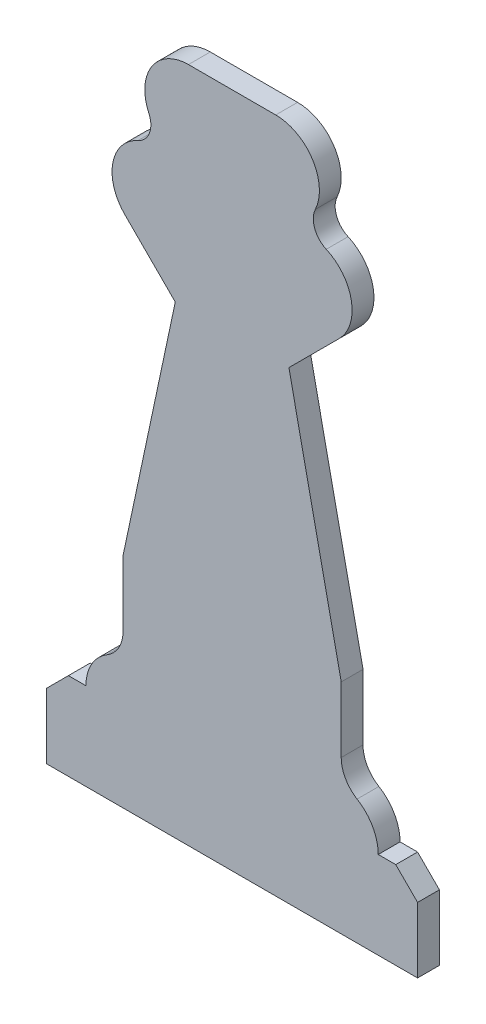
ISO-10303-21;
HEADER;
FILE_DESCRIPTION(('STEP AP214'),'2;1');
FILE_NAME('part.step','',(''),(''),'','','');
FILE_SCHEMA(('AUTOMOTIVE_DESIGN { 1 0 10303 214 1 1 1 1 }'));
ENDSEC;
DATA;
#1=APPLICATION_CONTEXT('core data for automotive mechanical design processes');
#2=APPLICATION_PROTOCOL_DEFINITION('international standard','automotive_design',2000,#1);
#3=PRODUCT_CONTEXT('',#1,'mechanical');
#4=PRODUCT('Part','Part','',(#3));
#5=PRODUCT_RELATED_PRODUCT_CATEGORY('part','',(#4));
#6=PRODUCT_DEFINITION_FORMATION('','',#4);
#7=PRODUCT_DEFINITION_CONTEXT('part definition',#1,'design');
#8=PRODUCT_DEFINITION('design','',#6,#7);
#9=PRODUCT_DEFINITION_SHAPE('','',#8);
#10=(LENGTH_UNIT() NAMED_UNIT(*) SI_UNIT(.MILLI.,.METRE.));
#11=(NAMED_UNIT(*) PLANE_ANGLE_UNIT() SI_UNIT($,.RADIAN.));
#12=(NAMED_UNIT(*) SI_UNIT($,.STERADIAN.) SOLID_ANGLE_UNIT());
#13=UNCERTAINTY_MEASURE_WITH_UNIT(LENGTH_MEASURE(1.E-05),#10,'distance_accuracy_value','');
#14=(GEOMETRIC_REPRESENTATION_CONTEXT(3) GLOBAL_UNCERTAINTY_ASSIGNED_CONTEXT((#13)) GLOBAL_UNIT_ASSIGNED_CONTEXT((#10,
#11,#12)) REPRESENTATION_CONTEXT('',''));
#15=CARTESIAN_POINT('',(0.,0.,0.));
#16=DIRECTION('',(0.,0.,1.));
#17=DIRECTION('',(1.,0.,0.));
#18=AXIS2_PLACEMENT_3D('',#15,#16,#17);
#19=CARTESIAN_POINT('',(-10.,20.,2.));
#20=DIRECTION('',(0.978147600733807,-0.207911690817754,0.));
#21=DIRECTION('',(0.207911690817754,0.978147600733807,0.));
#22=AXIS2_PLACEMENT_3D('',#19,#20,#21);
#23=PLANE('',#22);
#24=DIRECTION('',(-0.207911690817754,-0.978147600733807,0.));
#25=VECTOR('',#24,1.);
#26=CARTESIAN_POINT('',(-10.,20.,0.));
#27=LINE('',#26,#25);
#28=CARTESIAN_POINT('',(-5.20685036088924,42.5499961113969,0.));
#29=VERTEX_POINT('',#28);
#30=CARTESIAN_POINT('',(-10.,20.,0.));
#31=VERTEX_POINT('',#30);
#32=EDGE_CURVE('E229',#29,#31,#27,.T.);
#33=ORIENTED_EDGE('',*,*,#32,.T.);
#34=DIRECTION('',(0.,0.,-1.));
#35=VECTOR('',#34,1.);
#36=CARTESIAN_POINT('',(-10.,20.,2.));
#37=LINE('',#36,#35);
#38=CARTESIAN_POINT('',(-10.,20.,2.));
#39=VERTEX_POINT('',#38);
#40=EDGE_CURVE('E11',#39,#31,#37,.T.);
#41=ORIENTED_EDGE('',*,*,#40,.F.);
#42=DIRECTION('',(-0.207911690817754,-0.978147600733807,0.));
#43=VECTOR('',#42,1.);
#44=CARTESIAN_POINT('',(-10.,20.,2.));
#45=LINE('',#44,#43);
#46=CARTESIAN_POINT('',(-5.20685036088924,42.5499961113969,2.));
#47=VERTEX_POINT('',#46);
#48=EDGE_CURVE('E275',#47,#39,#45,.T.);
#49=ORIENTED_EDGE('',*,*,#48,.F.);
#50=DIRECTION('',(0.,0.,-1.));
#51=VECTOR('',#50,1.);
#52=CARTESIAN_POINT('',(-5.20685036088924,42.5499961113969,2.));
#53=LINE('',#52,#51);
#54=EDGE_CURVE('E225',#47,#29,#53,.T.);
#55=ORIENTED_EDGE('',*,*,#54,.T.);
#56=EDGE_LOOP('',(#33,#41,#49,#55));
#57=FACE_BOUND('',#56,.T.);
#58=ADVANCED_FACE('F37',(#57),#23,.F.);
#59=CARTESIAN_POINT('',(-10.,14.,2.));
#60=DIRECTION('',(1.,0.,0.));
#61=DIRECTION('',(0.,0.,-1.));
#62=AXIS2_PLACEMENT_3D('',#59,#60,#61);
#63=PLANE('',#62);
#64=DIRECTION('',(0.,-1.,0.));
#65=VECTOR('',#64,1.);
#66=CARTESIAN_POINT('',(-10.,14.,0.));
#67=LINE('',#66,#65);
#68=CARTESIAN_POINT('',(-10.,14.,0.));
#69=VERTEX_POINT('',#68);
#70=EDGE_CURVE('E232',#31,#69,#67,.T.);
#71=ORIENTED_EDGE('',*,*,#70,.T.);
#72=DIRECTION('',(0.,0.,-1.));
#73=VECTOR('',#72,1.);
#74=CARTESIAN_POINT('',(-10.,14.,2.));
#75=LINE('',#74,#73);
#76=CARTESIAN_POINT('',(-10.,14.,2.));
#77=VERTEX_POINT('',#76);
#78=EDGE_CURVE('E45',#77,#69,#75,.T.);
#79=ORIENTED_EDGE('',*,*,#78,.F.);
#80=DIRECTION('',(0.,-1.,0.));
#81=VECTOR('',#80,1.);
#82=CARTESIAN_POINT('',(-10.,14.,2.));
#83=LINE('',#82,#81);
#84=EDGE_CURVE('E144',#39,#77,#83,.T.);
#85=ORIENTED_EDGE('',*,*,#84,.F.);
#86=ORIENTED_EDGE('',*,*,#40,.T.);
#87=EDGE_LOOP('',(#71,#79,#85,#86));
#88=FACE_BOUND('',#87,.T.);
#89=ADVANCED_FACE('F413',(#88),#63,.F.);
#90=CARTESIAN_POINT('',(-13.,14.,2.));
#91=DIRECTION('',(0.,0.,-1.));
#92=DIRECTION('',(-1.,0.,0.));
#93=AXIS2_PLACEMENT_3D('',#90,#91,#92);
#94=CYLINDRICAL_SURFACE('',#93,3.);
#95=CARTESIAN_POINT('',(-13.,14.,0.));
#96=DIRECTION('',(0.,0.,-1.));
#97=DIRECTION('',(1.,0.,0.));
#98=AXIS2_PLACEMENT_3D('',#95,#96,#97);
#99=CIRCLE('',#98,3.);
#100=CARTESIAN_POINT('',(-11.4547637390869,11.4285714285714,0.));
#101=VERTEX_POINT('',#100);
#102=EDGE_CURVE('E234',#69,#101,#99,.T.);
#103=ORIENTED_EDGE('',*,*,#102,.T.);
#104=DIRECTION('',(0.,0.,-1.));
#105=VECTOR('',#104,1.);
#106=CARTESIAN_POINT('',(-11.4547637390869,11.4285714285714,2.));
#107=LINE('',#106,#105);
#108=CARTESIAN_POINT('',(-11.4547637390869,11.4285714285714,2.));
#109=VERTEX_POINT('',#108);
#110=EDGE_CURVE('E330',#109,#101,#107,.T.);
#111=ORIENTED_EDGE('',*,*,#110,.F.);
#112=CARTESIAN_POINT('',(-13.,14.,2.));
#113=DIRECTION('',(0.,0.,-1.));
#114=DIRECTION('',(1.,0.,0.));
#115=AXIS2_PLACEMENT_3D('',#112,#113,#114);
#116=CIRCLE('',#115,3.);
#117=EDGE_CURVE('E338',#77,#109,#116,.T.);
#118=ORIENTED_EDGE('',*,*,#117,.F.);
#119=ORIENTED_EDGE('',*,*,#78,.T.);
#120=EDGE_LOOP('',(#103,#111,#118,#119));
#121=FACE_BOUND('',#120,.T.);
#122=ADVANCED_FACE('F336',(#121),#94,.F.);
#123=CARTESIAN_POINT('',(-9.39444872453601,8.,2.));
#124=DIRECTION('',(0.,0.,-1.));
#125=DIRECTION('',(-1.,0.,0.));
#126=AXIS2_PLACEMENT_3D('',#123,#124,#125);
#127=CYLINDRICAL_SURFACE('',#126,4.);
#128=CARTESIAN_POINT('',(-9.39444872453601,8.,0.));
#129=DIRECTION('',(0.,0.,1.));
#130=DIRECTION('',(-1.,0.,0.));
#131=AXIS2_PLACEMENT_3D('',#128,#129,#130);
#132=CIRCLE('',#131,4.);
#133=CARTESIAN_POINT('',(-13.394448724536,8.,0.));
#134=VERTEX_POINT('',#133);
#135=EDGE_CURVE('E236',#101,#134,#132,.T.);
#136=ORIENTED_EDGE('',*,*,#135,.T.);
#137=DIRECTION('',(0.,0.,-1.));
#138=VECTOR('',#137,1.);
#139=CARTESIAN_POINT('',(-13.394448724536,8.,2.));
#140=LINE('',#139,#138);
#141=CARTESIAN_POINT('',(-13.394448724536,8.,2.));
#142=VERTEX_POINT('',#141);
#143=EDGE_CURVE('E327',#142,#134,#140,.T.);
#144=ORIENTED_EDGE('',*,*,#143,.F.);
#145=CARTESIAN_POINT('',(-9.39444872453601,8.,2.));
#146=DIRECTION('',(0.,0.,1.));
#147=DIRECTION('',(-1.,0.,0.));
#148=AXIS2_PLACEMENT_3D('',#145,#146,#147);
#149=CIRCLE('',#148,4.);
#150=EDGE_CURVE('E356',#109,#142,#149,.T.);
#151=ORIENTED_EDGE('',*,*,#150,.F.);
#152=ORIENTED_EDGE('',*,*,#110,.T.);
#153=EDGE_LOOP('',(#136,#144,#151,#152));
#154=FACE_BOUND('',#153,.T.);
#155=ADVANCED_FACE('F347',(#154),#127,.T.);
#156=CARTESIAN_POINT('',(-15.,8.,2.));
#157=DIRECTION('',(0.,-1.,0.));
#158=DIRECTION('',(1.,0.,0.));
#159=AXIS2_PLACEMENT_3D('',#156,#157,#158);
#160=PLANE('',#159);
#161=DIRECTION('',(-1.,0.,0.));
#162=VECTOR('',#161,1.);
#163=CARTESIAN_POINT('',(-15.,8.,0.));
#164=LINE('',#163,#162);
#165=CARTESIAN_POINT('',(-15.,8.,0.));
#166=VERTEX_POINT('',#165);
#167=EDGE_CURVE('E238',#134,#166,#164,.T.);
#168=ORIENTED_EDGE('',*,*,#167,.T.);
#169=DIRECTION('',(0.,0.,-1.));
#170=VECTOR('',#169,1.);
#171=CARTESIAN_POINT('',(-15.,8.,2.));
#172=LINE('',#171,#170);
#173=CARTESIAN_POINT('',(-15.,8.,2.));
#174=VERTEX_POINT('',#173);
#175=EDGE_CURVE('E324',#174,#166,#172,.T.);
#176=ORIENTED_EDGE('',*,*,#175,.F.);
#177=DIRECTION('',(-1.,0.,0.));
#178=VECTOR('',#177,1.);
#179=CARTESIAN_POINT('',(-15.,8.,2.));
#180=LINE('',#179,#178);
#181=EDGE_CURVE('E353',#142,#174,#180,.T.);
#182=ORIENTED_EDGE('',*,*,#181,.F.);
#183=ORIENTED_EDGE('',*,*,#143,.T.);
#184=EDGE_LOOP('',(#168,#176,#182,#183));
#185=FACE_BOUND('',#184,.T.);
#186=ADVANCED_FACE('F351',(#185),#160,.F.);
#187=CARTESIAN_POINT('',(-15.,8.,2.));
#188=DIRECTION('',(0.707106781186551,-0.707106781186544,0.));
#189=DIRECTION('',(0.707106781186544,0.707106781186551,0.));
#190=AXIS2_PLACEMENT_3D('',#187,#188,#189);
#191=PLANE('',#190);
#192=DIRECTION('',(-0.707106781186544,-0.707106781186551,0.));
#193=VECTOR('',#192,1.);
#194=CARTESIAN_POINT('',(-15.,8.,0.));
#195=LINE('',#194,#193);
#196=CARTESIAN_POINT('',(-17.,5.99999999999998,0.));
#197=VERTEX_POINT('',#196);
#198=EDGE_CURVE('E240',#166,#197,#195,.T.);
#199=ORIENTED_EDGE('',*,*,#198,.T.);
#200=DIRECTION('',(0.,0.,-1.));
#201=VECTOR('',#200,1.);
#202=CARTESIAN_POINT('',(-17.,5.99999999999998,2.));
#203=LINE('',#202,#201);
#204=CARTESIAN_POINT('',(-17.,5.99999999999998,2.));
#205=VERTEX_POINT('',#204);
#206=EDGE_CURVE('E321',#205,#197,#203,.T.);
#207=ORIENTED_EDGE('',*,*,#206,.F.);
#208=DIRECTION('',(-0.707106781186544,-0.707106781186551,0.));
#209=VECTOR('',#208,1.);
#210=CARTESIAN_POINT('',(-15.,8.,2.));
#211=LINE('',#210,#209);
#212=EDGE_CURVE('E355',#174,#205,#211,.T.);
#213=ORIENTED_EDGE('',*,*,#212,.F.);
#214=ORIENTED_EDGE('',*,*,#175,.T.);
#215=EDGE_LOOP('',(#199,#207,#213,#214));
#216=FACE_BOUND('',#215,.T.);
#217=ADVANCED_FACE('F426',(#216),#191,.F.);
#218=CARTESIAN_POINT('',(-17.,0.,2.));
#219=DIRECTION('',(1.,0.,0.));
#220=DIRECTION('',(0.,1.,0.));
#221=AXIS2_PLACEMENT_3D('',#218,#219,#220);
#222=PLANE('',#221);
#223=DIRECTION('',(0.,-1.,0.));
#224=VECTOR('',#223,1.);
#225=CARTESIAN_POINT('',(-17.,0.,0.));
#226=LINE('',#225,#224);
#227=CARTESIAN_POINT('',(-17.,0.,0.));
#228=VERTEX_POINT('',#227);
#229=EDGE_CURVE('E242',#197,#228,#226,.T.);
#230=ORIENTED_EDGE('',*,*,#229,.T.);
#231=DIRECTION('',(0.,0.,-1.));
#232=VECTOR('',#231,1.);
#233=CARTESIAN_POINT('',(-17.,0.,2.));
#234=LINE('',#233,#232);
#235=CARTESIAN_POINT('',(-17.,0.,2.));
#236=VERTEX_POINT('',#235);
#237=EDGE_CURVE('E318',#236,#228,#234,.T.);
#238=ORIENTED_EDGE('',*,*,#237,.F.);
#239=DIRECTION('',(0.,-1.,0.));
#240=VECTOR('',#239,1.);
#241=CARTESIAN_POINT('',(-17.,0.,2.));
#242=LINE('',#241,#240);
#243=EDGE_CURVE('E358',#205,#236,#242,.T.);
#244=ORIENTED_EDGE('',*,*,#243,.F.);
#245=ORIENTED_EDGE('',*,*,#206,.T.);
#246=EDGE_LOOP('',(#230,#238,#244,#245));
#247=FACE_BOUND('',#246,.T.);
#248=ADVANCED_FACE('F429',(#247),#222,.F.);
#249=CARTESIAN_POINT('',(-17.,0.,2.));
#250=DIRECTION('',(0.,1.,0.));
#251=DIRECTION('',(-1.,0.,0.));
#252=AXIS2_PLACEMENT_3D('',#249,#250,#251);
#253=PLANE('',#252);
#254=DIRECTION('',(1.,0.,0.));
#255=VECTOR('',#254,1.);
#256=CARTESIAN_POINT('',(-17.,0.,0.));
#257=LINE('',#256,#255);
#258=CARTESIAN_POINT('',(17.,0.,0.));
#259=VERTEX_POINT('',#258);
#260=EDGE_CURVE('E244',#228,#259,#257,.T.);
#261=ORIENTED_EDGE('',*,*,#260,.T.);
#262=DIRECTION('',(0.,0.,-1.));
#263=VECTOR('',#262,1.);
#264=CARTESIAN_POINT('',(17.,0.,2.));
#265=LINE('',#264,#263);
#266=CARTESIAN_POINT('',(17.,0.,2.));
#267=VERTEX_POINT('',#266);
#268=EDGE_CURVE('E315',#267,#259,#265,.T.);
#269=ORIENTED_EDGE('',*,*,#268,.F.);
#270=DIRECTION('',(1.,0.,0.));
#271=VECTOR('',#270,1.);
#272=CARTESIAN_POINT('',(-17.,0.,2.));
#273=LINE('',#272,#271);
#274=EDGE_CURVE('E364',#236,#267,#273,.T.);
#275=ORIENTED_EDGE('',*,*,#274,.F.);
#276=ORIENTED_EDGE('',*,*,#237,.T.);
#277=EDGE_LOOP('',(#261,#269,#275,#276));
#278=FACE_BOUND('',#277,.T.);
#279=ADVANCED_FACE('F433',(#278),#253,.F.);
#280=CARTESIAN_POINT('',(17.,0.,2.));
#281=DIRECTION('',(-1.,0.,0.));
#282=DIRECTION('',(0.,-1.,0.));
#283=AXIS2_PLACEMENT_3D('',#280,#281,#282);
#284=PLANE('',#283);
#285=DIRECTION('',(0.,1.,0.));
#286=VECTOR('',#285,1.);
#287=CARTESIAN_POINT('',(17.,0.,0.));
#288=LINE('',#287,#286);
#289=CARTESIAN_POINT('',(17.,5.99999999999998,0.));
#290=VERTEX_POINT('',#289);
#291=EDGE_CURVE('E246',#259,#290,#288,.T.);
#292=ORIENTED_EDGE('',*,*,#291,.T.);
#293=DIRECTION('',(0.,0.,-1.));
#294=VECTOR('',#293,1.);
#295=CARTESIAN_POINT('',(17.,5.99999999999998,2.));
#296=LINE('',#295,#294);
#297=CARTESIAN_POINT('',(17.,5.99999999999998,2.));
#298=VERTEX_POINT('',#297);
#299=EDGE_CURVE('E312',#298,#290,#296,.T.);
#300=ORIENTED_EDGE('',*,*,#299,.F.);
#301=DIRECTION('',(0.,1.,0.));
#302=VECTOR('',#301,1.);
#303=CARTESIAN_POINT('',(17.,0.,2.));
#304=LINE('',#303,#302);
#305=EDGE_CURVE('E366',#267,#298,#304,.T.);
#306=ORIENTED_EDGE('',*,*,#305,.F.);
#307=ORIENTED_EDGE('',*,*,#268,.T.);
#308=EDGE_LOOP('',(#292,#300,#306,#307));
#309=FACE_BOUND('',#308,.T.);
#310=ADVANCED_FACE('F437',(#309),#284,.F.);
#311=CARTESIAN_POINT('',(15.,8.,2.));
#312=DIRECTION('',(-0.707106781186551,-0.707106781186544,0.));
#313=DIRECTION('',(0.707106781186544,-0.707106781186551,0.));
#314=AXIS2_PLACEMENT_3D('',#311,#312,#313);
#315=PLANE('',#314);
#316=DIRECTION('',(-0.707106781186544,0.707106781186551,0.));
#317=VECTOR('',#316,1.);
#318=CARTESIAN_POINT('',(15.,8.,0.));
#319=LINE('',#318,#317);
#320=CARTESIAN_POINT('',(15.,8.,0.));
#321=VERTEX_POINT('',#320);
#322=EDGE_CURVE('E248',#290,#321,#319,.T.);
#323=ORIENTED_EDGE('',*,*,#322,.T.);
#324=DIRECTION('',(0.,0.,-1.));
#325=VECTOR('',#324,1.);
#326=CARTESIAN_POINT('',(15.,8.,2.));
#327=LINE('',#326,#325);
#328=CARTESIAN_POINT('',(15.,8.,2.));
#329=VERTEX_POINT('',#328);
#330=EDGE_CURVE('E309',#329,#321,#327,.T.);
#331=ORIENTED_EDGE('',*,*,#330,.F.);
#332=DIRECTION('',(-0.707106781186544,0.707106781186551,0.));
#333=VECTOR('',#332,1.);
#334=CARTESIAN_POINT('',(15.,8.,2.));
#335=LINE('',#334,#333);
#336=EDGE_CURVE('E368',#298,#329,#335,.T.);
#337=ORIENTED_EDGE('',*,*,#336,.F.);
#338=ORIENTED_EDGE('',*,*,#299,.T.);
#339=EDGE_LOOP('',(#323,#331,#337,#338));
#340=FACE_BOUND('',#339,.T.);
#341=ADVANCED_FACE('F441',(#340),#315,.F.);
#342=CARTESIAN_POINT('',(15.,8.,2.));
#343=DIRECTION('',(0.,-1.,0.));
#344=DIRECTION('',(1.,0.,0.));
#345=AXIS2_PLACEMENT_3D('',#342,#343,#344);
#346=PLANE('',#345);
#347=DIRECTION('',(-1.,0.,0.));
#348=VECTOR('',#347,1.);
#349=CARTESIAN_POINT('',(15.,8.,0.));
#350=LINE('',#349,#348);
#351=CARTESIAN_POINT('',(13.394448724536,8.,0.));
#352=VERTEX_POINT('',#351);
#353=EDGE_CURVE('E250',#321,#352,#350,.T.);
#354=ORIENTED_EDGE('',*,*,#353,.T.);
#355=DIRECTION('',(0.,0.,-1.));
#356=VECTOR('',#355,1.);
#357=CARTESIAN_POINT('',(13.394448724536,8.,2.));
#358=LINE('',#357,#356);
#359=CARTESIAN_POINT('',(13.394448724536,8.,2.));
#360=VERTEX_POINT('',#359);
#361=EDGE_CURVE('E306',#360,#352,#358,.T.);
#362=ORIENTED_EDGE('',*,*,#361,.F.);
#363=DIRECTION('',(-1.,0.,0.));
#364=VECTOR('',#363,1.);
#365=CARTESIAN_POINT('',(15.,8.,2.));
#366=LINE('',#365,#364);
#367=EDGE_CURVE('E370',#329,#360,#366,.T.);
#368=ORIENTED_EDGE('',*,*,#367,.F.);
#369=ORIENTED_EDGE('',*,*,#330,.T.);
#370=EDGE_LOOP('',(#354,#362,#368,#369));
#371=FACE_BOUND('',#370,.T.);
#372=ADVANCED_FACE('F445',(#371),#346,.F.);
#373=CARTESIAN_POINT('',(9.39444872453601,8.,2.));
#374=DIRECTION('',(0.,0.,-1.));
#375=DIRECTION('',(-1.,0.,0.));
#376=AXIS2_PLACEMENT_3D('',#373,#374,#375);
#377=CYLINDRICAL_SURFACE('',#376,4.);
#378=CARTESIAN_POINT('',(9.39444872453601,8.,0.));
#379=DIRECTION('',(0.,0.,1.));
#380=DIRECTION('',(1.,0.,0.));
#381=AXIS2_PLACEMENT_3D('',#378,#379,#380);
#382=CIRCLE('',#381,4.);
#383=CARTESIAN_POINT('',(11.4547637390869,11.4285714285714,0.));
#384=VERTEX_POINT('',#383);
#385=EDGE_CURVE('E252',#352,#384,#382,.T.);
#386=ORIENTED_EDGE('',*,*,#385,.T.);
#387=DIRECTION('',(0.,0.,-1.));
#388=VECTOR('',#387,1.);
#389=CARTESIAN_POINT('',(11.4547637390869,11.4285714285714,2.));
#390=LINE('',#389,#388);
#391=CARTESIAN_POINT('',(11.4547637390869,11.4285714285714,2.));
#392=VERTEX_POINT('',#391);
#393=EDGE_CURVE('E303',#392,#384,#390,.T.);
#394=ORIENTED_EDGE('',*,*,#393,.F.);
#395=CARTESIAN_POINT('',(9.39444872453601,8.,2.));
#396=DIRECTION('',(0.,0.,1.));
#397=DIRECTION('',(1.,0.,0.));
#398=AXIS2_PLACEMENT_3D('',#395,#396,#397);
#399=CIRCLE('',#398,4.);
#400=EDGE_CURVE('E372',#360,#392,#399,.T.);
#401=ORIENTED_EDGE('',*,*,#400,.F.);
#402=ORIENTED_EDGE('',*,*,#361,.T.);
#403=EDGE_LOOP('',(#386,#394,#401,#402));
#404=FACE_BOUND('',#403,.T.);
#405=ADVANCED_FACE('F449',(#404),#377,.T.);
#406=CARTESIAN_POINT('',(13.,14.,2.));
#407=DIRECTION('',(0.,0.,-1.));
#408=DIRECTION('',(-1.,0.,0.));
#409=AXIS2_PLACEMENT_3D('',#406,#407,#408);
#410=CYLINDRICAL_SURFACE('',#409,3.);
#411=CARTESIAN_POINT('',(13.,14.,0.));
#412=DIRECTION('',(0.,0.,-1.));
#413=DIRECTION('',(-1.,0.,0.));
#414=AXIS2_PLACEMENT_3D('',#411,#412,#413);
#415=CIRCLE('',#414,3.);
#416=CARTESIAN_POINT('',(10.,14.,0.));
#417=VERTEX_POINT('',#416);
#418=EDGE_CURVE('E254',#384,#417,#415,.T.);
#419=ORIENTED_EDGE('',*,*,#418,.T.);
#420=DIRECTION('',(0.,0.,-1.));
#421=VECTOR('',#420,1.);
#422=CARTESIAN_POINT('',(10.,14.,2.));
#423=LINE('',#422,#421);
#424=CARTESIAN_POINT('',(10.,14.,2.));
#425=VERTEX_POINT('',#424);
#426=EDGE_CURVE('E300',#425,#417,#423,.T.);
#427=ORIENTED_EDGE('',*,*,#426,.F.);
#428=CARTESIAN_POINT('',(13.,14.,2.));
#429=DIRECTION('',(0.,0.,-1.));
#430=DIRECTION('',(-1.,0.,0.));
#431=AXIS2_PLACEMENT_3D('',#428,#429,#430);
#432=CIRCLE('',#431,3.);
#433=EDGE_CURVE('E374',#392,#425,#432,.T.);
#434=ORIENTED_EDGE('',*,*,#433,.F.);
#435=ORIENTED_EDGE('',*,*,#393,.T.);
#436=EDGE_LOOP('',(#419,#427,#434,#435));
#437=FACE_BOUND('',#436,.T.);
#438=ADVANCED_FACE('F453',(#437),#410,.F.);
#439=CARTESIAN_POINT('',(10.,14.,2.));
#440=DIRECTION('',(-1.,0.,0.));
#441=DIRECTION('',(0.,0.,1.));
#442=AXIS2_PLACEMENT_3D('',#439,#440,#441);
#443=PLANE('',#442);
#444=DIRECTION('',(0.,1.,0.));
#445=VECTOR('',#444,1.);
#446=CARTESIAN_POINT('',(10.,14.,0.));
#447=LINE('',#446,#445);
#448=CARTESIAN_POINT('',(10.,20.,0.));
#449=VERTEX_POINT('',#448);
#450=EDGE_CURVE('E256',#417,#449,#447,.T.);
#451=ORIENTED_EDGE('',*,*,#450,.T.);
#452=DIRECTION('',(0.,0.,-1.));
#453=VECTOR('',#452,1.);
#454=CARTESIAN_POINT('',(10.,20.,2.));
#455=LINE('',#454,#453);
#456=CARTESIAN_POINT('',(10.,20.,2.));
#457=VERTEX_POINT('',#456);
#458=EDGE_CURVE('E297',#457,#449,#455,.T.);
#459=ORIENTED_EDGE('',*,*,#458,.F.);
#460=DIRECTION('',(0.,1.,0.));
#461=VECTOR('',#460,1.);
#462=CARTESIAN_POINT('',(10.,14.,2.));
#463=LINE('',#462,#461);
#464=EDGE_CURVE('E376',#425,#457,#463,.T.);
#465=ORIENTED_EDGE('',*,*,#464,.F.);
#466=ORIENTED_EDGE('',*,*,#426,.T.);
#467=EDGE_LOOP('',(#451,#459,#465,#466));
#468=FACE_BOUND('',#467,.T.);
#469=ADVANCED_FACE('F457',(#468),#443,.F.);
#470=CARTESIAN_POINT('',(10.,20.,2.));
#471=DIRECTION('',(-0.978147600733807,-0.207911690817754,0.));
#472=DIRECTION('',(0.207911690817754,-0.978147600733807,0.));
#473=AXIS2_PLACEMENT_3D('',#470,#471,#472);
#474=PLANE('',#473);
#475=DIRECTION('',(-0.207911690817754,0.978147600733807,0.));
#476=VECTOR('',#475,1.);
#477=CARTESIAN_POINT('',(10.,20.,0.));
#478=LINE('',#477,#476);
#479=CARTESIAN_POINT('',(5.20685036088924,42.5499961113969,0.));
#480=VERTEX_POINT('',#479);
#481=EDGE_CURVE('E258',#449,#480,#478,.T.);
#482=ORIENTED_EDGE('',*,*,#481,.T.);
#483=DIRECTION('',(0.,0.,-1.));
#484=VECTOR('',#483,1.);
#485=CARTESIAN_POINT('',(5.20685036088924,42.5499961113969,2.));
#486=LINE('',#485,#484);
#487=CARTESIAN_POINT('',(5.20685036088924,42.5499961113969,2.));
#488=VERTEX_POINT('',#487);
#489=EDGE_CURVE('E294',#488,#480,#486,.T.);
#490=ORIENTED_EDGE('',*,*,#489,.F.);
#491=DIRECTION('',(-0.207911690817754,0.978147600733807,0.));
#492=VECTOR('',#491,1.);
#493=CARTESIAN_POINT('',(10.,20.,2.));
#494=LINE('',#493,#492);
#495=EDGE_CURVE('E378',#457,#488,#494,.T.);
#496=ORIENTED_EDGE('',*,*,#495,.F.);
#497=ORIENTED_EDGE('',*,*,#458,.T.);
#498=EDGE_LOOP('',(#482,#490,#496,#497));
#499=FACE_BOUND('',#498,.T.);
#500=ADVANCED_FACE('F461',(#499),#474,.F.);
#501=CARTESIAN_POINT('',(9.82842712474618,47.1715728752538,2.));
#502=DIRECTION('',(-0.707106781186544,0.707106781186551,0.));
#503=DIRECTION('',(-0.707106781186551,-0.707106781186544,0.));
#504=AXIS2_PLACEMENT_3D('',#501,#502,#503);
#505=PLANE('',#504);
#506=DIRECTION('',(0.707106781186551,0.707106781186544,0.));
#507=VECTOR('',#506,1.);
#508=CARTESIAN_POINT('',(9.82842712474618,47.1715728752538,0.));
#509=LINE('',#508,#507);
#510=CARTESIAN_POINT('',(9.82842712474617,47.1715728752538,0.));
#511=VERTEX_POINT('',#510);
#512=EDGE_CURVE('E260',#480,#511,#509,.T.);
#513=ORIENTED_EDGE('',*,*,#512,.T.);
#514=DIRECTION('',(0.,0.,-1.));
#515=VECTOR('',#514,1.);
#516=CARTESIAN_POINT('',(9.82842712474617,47.1715728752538,2.));
#517=LINE('',#516,#515);
#518=CARTESIAN_POINT('',(9.82842712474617,47.1715728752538,2.));
#519=VERTEX_POINT('',#518);
#520=EDGE_CURVE('E291',#519,#511,#517,.T.);
#521=ORIENTED_EDGE('',*,*,#520,.F.);
#522=DIRECTION('',(0.707106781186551,0.707106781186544,0.));
#523=VECTOR('',#522,1.);
#524=CARTESIAN_POINT('',(9.82842712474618,47.1715728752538,2.));
#525=LINE('',#524,#523);
#526=EDGE_CURVE('E380',#488,#519,#525,.T.);
#527=ORIENTED_EDGE('',*,*,#526,.F.);
#528=ORIENTED_EDGE('',*,*,#489,.T.);
#529=EDGE_LOOP('',(#513,#521,#527,#528));
#530=FACE_BOUND('',#529,.T.);
#531=ADVANCED_FACE('F465',(#530),#505,.F.);
#532=CARTESIAN_POINT('',(7.,50.,2.));
#533=DIRECTION('',(0.,0.,-1.));
#534=DIRECTION('',(-1.,0.,0.));
#535=AXIS2_PLACEMENT_3D('',#532,#533,#534);
#536=CYLINDRICAL_SURFACE('',#535,4.);
#537=CARTESIAN_POINT('',(7.,50.,0.));
#538=DIRECTION('',(0.,0.,1.));
#539=DIRECTION('',(1.,0.,0.));
#540=AXIS2_PLACEMENT_3D('',#537,#538,#539);
#541=CIRCLE('',#540,4.);
#542=CARTESIAN_POINT('',(8.62988329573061,53.6528729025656,0.));
#543=VERTEX_POINT('',#542);
#544=EDGE_CURVE('E262',#511,#543,#541,.T.);
#545=ORIENTED_EDGE('',*,*,#544,.T.);
#546=DIRECTION('',(0.,0.,-1.));
#547=VECTOR('',#546,1.);
#548=CARTESIAN_POINT('',(8.62988329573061,53.6528729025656,2.));
#549=LINE('',#548,#547);
#550=CARTESIAN_POINT('',(8.62988329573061,53.6528729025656,2.));
#551=VERTEX_POINT('',#550);
#552=EDGE_CURVE('E288',#551,#543,#549,.T.);
#553=ORIENTED_EDGE('',*,*,#552,.F.);
#554=CARTESIAN_POINT('',(7.,50.,2.));
#555=DIRECTION('',(0.,0.,1.));
#556=DIRECTION('',(1.,0.,0.));
#557=AXIS2_PLACEMENT_3D('',#554,#555,#556);
#558=CIRCLE('',#557,4.);
#559=EDGE_CURVE('E382',#519,#551,#558,.T.);
#560=ORIENTED_EDGE('',*,*,#559,.F.);
#561=ORIENTED_EDGE('',*,*,#520,.T.);
#562=EDGE_LOOP('',(#545,#553,#560,#561));
#563=FACE_BOUND('',#562,.T.);
#564=ADVANCED_FACE('F469',(#563),#536,.T.);
#565=CARTESIAN_POINT('',(9.44482494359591,55.4793093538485,2.));
#566=DIRECTION('',(0.,0.,-1.));
#567=DIRECTION('',(-1.,0.,0.));
#568=AXIS2_PLACEMENT_3D('',#565,#566,#567);
#569=CYLINDRICAL_SURFACE('',#568,2.00000000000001);
#570=CARTESIAN_POINT('',(9.44482494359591,55.4793093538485,0.));
#571=DIRECTION('',(0.,0.,-1.));
#572=DIRECTION('',(1.,0.,0.));
#573=AXIS2_PLACEMENT_3D('',#570,#571,#572);
#574=CIRCLE('',#573,2.00000000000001);
#575=CARTESIAN_POINT('',(7.6298832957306,56.3195395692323,0.));
#576=VERTEX_POINT('',#575);
#577=EDGE_CURVE('E264',#543,#576,#574,.T.);
#578=ORIENTED_EDGE('',*,*,#577,.T.);
#579=DIRECTION('',(0.,0.,-1.));
#580=VECTOR('',#579,1.);
#581=CARTESIAN_POINT('',(7.6298832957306,56.3195395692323,2.));
#582=LINE('',#581,#580);
#583=CARTESIAN_POINT('',(7.6298832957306,56.3195395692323,2.));
#584=VERTEX_POINT('',#583);
#585=EDGE_CURVE('E285',#584,#576,#582,.T.);
#586=ORIENTED_EDGE('',*,*,#585,.F.);
#587=CARTESIAN_POINT('',(9.44482494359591,55.4793093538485,2.));
#588=DIRECTION('',(0.,0.,-1.));
#589=DIRECTION('',(1.,0.,0.));
#590=AXIS2_PLACEMENT_3D('',#587,#588,#589);
#591=CIRCLE('',#590,2.00000000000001);
#592=EDGE_CURVE('E384',#551,#584,#591,.T.);
#593=ORIENTED_EDGE('',*,*,#592,.F.);
#594=ORIENTED_EDGE('',*,*,#552,.T.);
#595=EDGE_LOOP('',(#578,#586,#593,#594));
#596=FACE_BOUND('',#595,.T.);
#597=ADVANCED_FACE('F473',(#596),#569,.F.);
#598=CARTESIAN_POINT('',(4.,58.,2.));
#599=DIRECTION('',(0.,0.,-1.));
#600=DIRECTION('',(-1.,0.,0.));
#601=AXIS2_PLACEMENT_3D('',#598,#599,#600);
#602=CYLINDRICAL_SURFACE('',#601,4.);
#603=CARTESIAN_POINT('',(4.,58.,0.));
#604=DIRECTION('',(0.,0.,1.));
#605=DIRECTION('',(1.,0.,0.));
#606=AXIS2_PLACEMENT_3D('',#603,#604,#605);
#607=CIRCLE('',#606,4.);
#608=CARTESIAN_POINT('',(4.,62.,0.));
#609=VERTEX_POINT('',#608);
#610=EDGE_CURVE('E266',#576,#609,#607,.T.);
#611=ORIENTED_EDGE('',*,*,#610,.T.);
#612=DIRECTION('',(0.,0.,-1.));
#613=VECTOR('',#612,1.);
#614=CARTESIAN_POINT('',(4.,62.,2.));
#615=LINE('',#614,#613);
#616=CARTESIAN_POINT('',(4.,62.,2.));
#617=VERTEX_POINT('',#616);
#618=EDGE_CURVE('E282',#617,#609,#615,.T.);
#619=ORIENTED_EDGE('',*,*,#618,.F.);
#620=CARTESIAN_POINT('',(4.,58.,2.));
#621=DIRECTION('',(0.,0.,1.));
#622=DIRECTION('',(1.,0.,0.));
#623=AXIS2_PLACEMENT_3D('',#620,#621,#622);
#624=CIRCLE('',#623,4.);
#625=EDGE_CURVE('E386',#584,#617,#624,.T.);
#626=ORIENTED_EDGE('',*,*,#625,.F.);
#627=ORIENTED_EDGE('',*,*,#585,.T.);
#628=EDGE_LOOP('',(#611,#619,#626,#627));
#629=FACE_BOUND('',#628,.T.);
#630=ADVANCED_FACE('F477',(#629),#602,.T.);
#631=CARTESIAN_POINT('',(4.,62.,2.));
#632=DIRECTION('',(0.,-1.,0.));
#633=DIRECTION('',(0.,0.,-1.));
#634=AXIS2_PLACEMENT_3D('',#631,#632,#633);
#635=PLANE('',#634);
#636=DIRECTION('',(-1.,0.,0.));
#637=VECTOR('',#636,1.);
#638=CARTESIAN_POINT('',(4.,62.,0.));
#639=LINE('',#638,#637);
#640=CARTESIAN_POINT('',(-4.,62.,0.));
#641=VERTEX_POINT('',#640);
#642=EDGE_CURVE('E268',#609,#641,#639,.T.);
#643=ORIENTED_EDGE('',*,*,#642,.T.);
#644=DIRECTION('',(0.,0.,-1.));
#645=VECTOR('',#644,1.);
#646=CARTESIAN_POINT('',(-4.,62.,2.));
#647=LINE('',#646,#645);
#648=CARTESIAN_POINT('',(-4.,62.,2.));
#649=VERTEX_POINT('',#648);
#650=EDGE_CURVE('E279',#649,#641,#647,.T.);
#651=ORIENTED_EDGE('',*,*,#650,.F.);
#652=DIRECTION('',(-1.,0.,0.));
#653=VECTOR('',#652,1.);
#654=CARTESIAN_POINT('',(4.,62.,2.));
#655=LINE('',#654,#653);
#656=EDGE_CURVE('E388',#617,#649,#655,.T.);
#657=ORIENTED_EDGE('',*,*,#656,.F.);
#658=ORIENTED_EDGE('',*,*,#618,.T.);
#659=EDGE_LOOP('',(#643,#651,#657,#658));
#660=FACE_BOUND('',#659,.T.);
#661=ADVANCED_FACE('F394',(#660),#635,.F.);
#662=CARTESIAN_POINT('',(-4.,58.,2.));
#663=DIRECTION('',(0.,0.,-1.));
#664=DIRECTION('',(-1.,0.,0.));
#665=AXIS2_PLACEMENT_3D('',#662,#663,#664);
#666=CYLINDRICAL_SURFACE('',#665,4.);
#667=CARTESIAN_POINT('',(-4.,58.,0.));
#668=DIRECTION('',(0.,0.,1.));
#669=DIRECTION('',(-1.,0.,0.));
#670=AXIS2_PLACEMENT_3D('',#667,#668,#669);
#671=CIRCLE('',#670,4.);
#672=CARTESIAN_POINT('',(-7.6298832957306,56.3195395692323,0.));
#673=VERTEX_POINT('',#672);
#674=EDGE_CURVE('E270',#641,#673,#671,.T.);
#675=ORIENTED_EDGE('',*,*,#674,.T.);
#676=DIRECTION('',(0.,0.,-1.));
#677=VECTOR('',#676,1.);
#678=CARTESIAN_POINT('',(-7.6298832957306,56.3195395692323,2.));
#679=LINE('',#678,#677);
#680=CARTESIAN_POINT('',(-7.6298832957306,56.3195395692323,2.));
#681=VERTEX_POINT('',#680);
#682=EDGE_CURVE('E220',#681,#673,#679,.T.);
#683=ORIENTED_EDGE('',*,*,#682,.F.);
#684=CARTESIAN_POINT('',(-4.,58.,2.));
#685=DIRECTION('',(0.,0.,1.));
#686=DIRECTION('',(-1.,0.,0.));
#687=AXIS2_PLACEMENT_3D('',#684,#685,#686);
#688=CIRCLE('',#687,4.);
#689=EDGE_CURVE('E211',#649,#681,#688,.T.);
#690=ORIENTED_EDGE('',*,*,#689,.F.);
#691=ORIENTED_EDGE('',*,*,#650,.T.);
#692=EDGE_LOOP('',(#675,#683,#690,#691));
#693=FACE_BOUND('',#692,.T.);
#694=ADVANCED_FACE('F398',(#693),#666,.T.);
#695=CARTESIAN_POINT('',(-9.44482494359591,55.4793093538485,2.));
#696=DIRECTION('',(0.,0.,-1.));
#697=DIRECTION('',(-1.,0.,0.));
#698=AXIS2_PLACEMENT_3D('',#695,#696,#697);
#699=CYLINDRICAL_SURFACE('',#698,2.00000000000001);
#700=CARTESIAN_POINT('',(-9.44482494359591,55.4793093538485,0.));
#701=DIRECTION('',(0.,0.,-1.));
#702=DIRECTION('',(-1.,0.,0.));
#703=AXIS2_PLACEMENT_3D('',#700,#701,#702);
#704=CIRCLE('',#703,2.00000000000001);
#705=CARTESIAN_POINT('',(-8.62988329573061,53.6528729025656,0.));
#706=VERTEX_POINT('',#705);
#707=EDGE_CURVE('E219',#673,#706,#704,.T.);
#708=ORIENTED_EDGE('',*,*,#707,.T.);
#709=DIRECTION('',(0.,0.,-1.));
#710=VECTOR('',#709,1.);
#711=CARTESIAN_POINT('',(-8.62988329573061,53.6528729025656,2.));
#712=LINE('',#711,#710);
#713=CARTESIAN_POINT('',(-8.62988329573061,53.6528729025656,2.));
#714=VERTEX_POINT('',#713);
#715=EDGE_CURVE('E216',#714,#706,#712,.T.);
#716=ORIENTED_EDGE('',*,*,#715,.F.);
#717=CARTESIAN_POINT('',(-9.44482494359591,55.4793093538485,2.));
#718=DIRECTION('',(0.,0.,-1.));
#719=DIRECTION('',(-1.,0.,0.));
#720=AXIS2_PLACEMENT_3D('',#717,#718,#719);
#721=CIRCLE('',#720,2.00000000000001);
#722=EDGE_CURVE('E205',#681,#714,#721,.T.);
#723=ORIENTED_EDGE('',*,*,#722,.F.);
#724=ORIENTED_EDGE('',*,*,#682,.T.);
#725=EDGE_LOOP('',(#708,#716,#723,#724));
#726=FACE_BOUND('',#725,.T.);
#727=ADVANCED_FACE('F217',(#726),#699,.F.);
#728=CARTESIAN_POINT('',(-7.,50.,2.));
#729=DIRECTION('',(0.,0.,-1.));
#730=DIRECTION('',(-1.,0.,0.));
#731=AXIS2_PLACEMENT_3D('',#728,#729,#730);
#732=CYLINDRICAL_SURFACE('',#731,4.);
#733=CARTESIAN_POINT('',(-7.,50.,0.));
#734=DIRECTION('',(0.,0.,1.));
#735=DIRECTION('',(-1.,0.,0.));
#736=AXIS2_PLACEMENT_3D('',#733,#734,#735);
#737=CIRCLE('',#736,4.);
#738=CARTESIAN_POINT('',(-9.82842712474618,47.1715728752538,0.));
#739=VERTEX_POINT('',#738);
#740=EDGE_CURVE('E130',#706,#739,#737,.T.);
#741=ORIENTED_EDGE('',*,*,#740,.T.);
#742=DIRECTION('',(0.,0.,-1.));
#743=VECTOR('',#742,1.);
#744=CARTESIAN_POINT('',(-9.82842712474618,47.1715728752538,2.));
#745=LINE('',#744,#743);
#746=CARTESIAN_POINT('',(-9.82842712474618,47.1715728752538,2.));
#747=VERTEX_POINT('',#746);
#748=EDGE_CURVE('E221',#747,#739,#745,.T.);
#749=ORIENTED_EDGE('',*,*,#748,.F.);
#750=CARTESIAN_POINT('',(-7.,50.,2.));
#751=DIRECTION('',(0.,0.,1.));
#752=DIRECTION('',(-1.,0.,0.));
#753=AXIS2_PLACEMENT_3D('',#750,#751,#752);
#754=CIRCLE('',#753,4.);
#755=EDGE_CURVE('E209',#714,#747,#754,.T.);
#756=ORIENTED_EDGE('',*,*,#755,.F.);
#757=ORIENTED_EDGE('',*,*,#715,.T.);
#758=EDGE_LOOP('',(#741,#749,#756,#757));
#759=FACE_BOUND('',#758,.T.);
#760=ADVANCED_FACE('F223',(#759),#732,.T.);
#761=CARTESIAN_POINT('',(-9.82842712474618,47.1715728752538,2.));
#762=DIRECTION('',(0.707106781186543,0.707106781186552,0.));
#763=DIRECTION('',(-0.707106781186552,0.707106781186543,0.));
#764=AXIS2_PLACEMENT_3D('',#761,#762,#763);
#765=PLANE('',#764);
#766=DIRECTION('',(0.707106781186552,-0.707106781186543,0.));
#767=VECTOR('',#766,1.);
#768=CARTESIAN_POINT('',(-9.82842712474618,47.1715728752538,0.));
#769=LINE('',#768,#767);
#770=EDGE_CURVE('E136',#739,#29,#769,.T.);
#771=ORIENTED_EDGE('',*,*,#770,.T.);
#772=ORIENTED_EDGE('',*,*,#54,.F.);
#773=DIRECTION('',(0.707106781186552,-0.707106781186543,0.));
#774=VECTOR('',#773,1.);
#775=CARTESIAN_POINT('',(-9.82842712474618,47.1715728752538,2.));
#776=LINE('',#775,#774);
#777=EDGE_CURVE('E53',#747,#47,#776,.T.);
#778=ORIENTED_EDGE('',*,*,#777,.F.);
#779=ORIENTED_EDGE('',*,*,#748,.T.);
#780=EDGE_LOOP('',(#771,#772,#778,#779));
#781=FACE_BOUND('',#780,.T.);
#782=ADVANCED_FACE('F402',(#781),#765,.F.);
#783=CARTESIAN_POINT('',(-7.,50.,2.));
#784=DIRECTION('',(0.,0.,-1.));
#785=DIRECTION('',(-1.,0.,0.));
#786=AXIS2_PLACEMENT_3D('',#783,#784,#785);
#787=PLANE('',#786);
#788=ORIENTED_EDGE('',*,*,#48,.T.);
#789=ORIENTED_EDGE('',*,*,#84,.T.);
#790=ORIENTED_EDGE('',*,*,#117,.T.);
#791=ORIENTED_EDGE('',*,*,#150,.T.);
#792=ORIENTED_EDGE('',*,*,#181,.T.);
#793=ORIENTED_EDGE('',*,*,#212,.T.);
#794=ORIENTED_EDGE('',*,*,#243,.T.);
#795=ORIENTED_EDGE('',*,*,#274,.T.);
#796=ORIENTED_EDGE('',*,*,#305,.T.);
#797=ORIENTED_EDGE('',*,*,#336,.T.);
#798=ORIENTED_EDGE('',*,*,#367,.T.);
#799=ORIENTED_EDGE('',*,*,#400,.T.);
#800=ORIENTED_EDGE('',*,*,#433,.T.);
#801=ORIENTED_EDGE('',*,*,#464,.T.);
#802=ORIENTED_EDGE('',*,*,#495,.T.);
#803=ORIENTED_EDGE('',*,*,#526,.T.);
#804=ORIENTED_EDGE('',*,*,#559,.T.);
#805=ORIENTED_EDGE('',*,*,#592,.T.);
#806=ORIENTED_EDGE('',*,*,#625,.T.);
#807=ORIENTED_EDGE('',*,*,#656,.T.);
#808=ORIENTED_EDGE('',*,*,#689,.T.);
#809=ORIENTED_EDGE('',*,*,#722,.T.);
#810=ORIENTED_EDGE('',*,*,#755,.T.);
#811=ORIENTED_EDGE('',*,*,#777,.T.);
#812=EDGE_LOOP('',(#788,#789,#790,#791,#792,#793,#794,#795,#796,#797,#798,#799,#800,#801,#802,
#803,#804,#805,#806,#807,#808,#809,#810,#811));
#813=FACE_BOUND('',#812,.T.);
#814=ADVANCED_FACE('F207',(#813),#787,.F.);
#815=CARTESIAN_POINT('',(-7.,50.,0.));
#816=DIRECTION('',(0.,0.,-1.));
#817=DIRECTION('',(-1.,0.,0.));
#818=AXIS2_PLACEMENT_3D('',#815,#816,#817);
#819=PLANE('',#818);
#820=ORIENTED_EDGE('',*,*,#32,.F.);
#821=ORIENTED_EDGE('',*,*,#770,.F.);
#822=ORIENTED_EDGE('',*,*,#740,.F.);
#823=ORIENTED_EDGE('',*,*,#707,.F.);
#824=ORIENTED_EDGE('',*,*,#674,.F.);
#825=ORIENTED_EDGE('',*,*,#642,.F.);
#826=ORIENTED_EDGE('',*,*,#610,.F.);
#827=ORIENTED_EDGE('',*,*,#577,.F.);
#828=ORIENTED_EDGE('',*,*,#544,.F.);
#829=ORIENTED_EDGE('',*,*,#512,.F.);
#830=ORIENTED_EDGE('',*,*,#481,.F.);
#831=ORIENTED_EDGE('',*,*,#450,.F.);
#832=ORIENTED_EDGE('',*,*,#418,.F.);
#833=ORIENTED_EDGE('',*,*,#385,.F.);
#834=ORIENTED_EDGE('',*,*,#353,.F.);
#835=ORIENTED_EDGE('',*,*,#322,.F.);
#836=ORIENTED_EDGE('',*,*,#291,.F.);
#837=ORIENTED_EDGE('',*,*,#260,.F.);
#838=ORIENTED_EDGE('',*,*,#229,.F.);
#839=ORIENTED_EDGE('',*,*,#198,.F.);
#840=ORIENTED_EDGE('',*,*,#167,.F.);
#841=ORIENTED_EDGE('',*,*,#135,.F.);
#842=ORIENTED_EDGE('',*,*,#102,.F.);
#843=ORIENTED_EDGE('',*,*,#70,.F.);
#844=EDGE_LOOP('',(#820,#821,#822,#823,#824,#825,#826,#827,#828,#829,#830,#831,#832,#833,#834,
#835,#836,#837,#838,#839,#840,#841,#842,#843));
#845=FACE_BOUND('',#844,.T.);
#846=ADVANCED_FACE('F342',(#845),#819,.T.);
#847=CLOSED_SHELL('',(#58,#89,#122,#155,#186,#217,#248,#279,#310,#341,#372,#405,#438,#469,#500,
#531,#564,#597,#630,#661,#694,#727,#760,#782,#814,#846));
#848=MANIFOLD_SOLID_BREP('B2',#847);
#849=ADVANCED_BREP_SHAPE_REPRESENTATION('',(#18,#848),#14);
#850=SHAPE_DEFINITION_REPRESENTATION(#9,#849);
ENDSEC;
END-ISO-10303-21;
